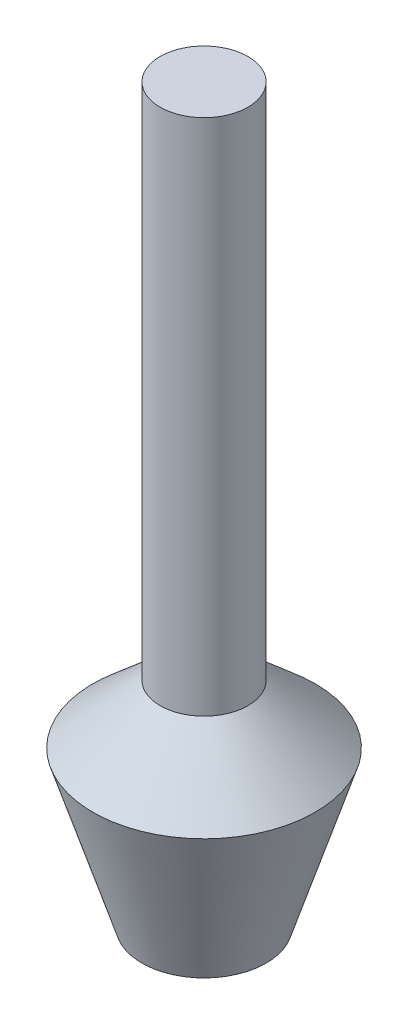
from build123d import *


with BuildPart() as part:
    # Sketch1 → Base-Revolve (revolve)
    with BuildSketch(Plane.XY, mode=Mode.PRIVATE) as base_revolve_sk:
        Polygon((3.81, 63.5), (3.81, 18.542), (9.652, 13.462), (5.3975, 0), (0, 0), (0, 63.5), align=None)
    revolve(base_revolve_sk.sketch.rotate(Axis((0, 0, 0), (0, 1, 0)), 90), axis=Axis((0, 0, 0), (0, 1, 0)))


solid = part.part
